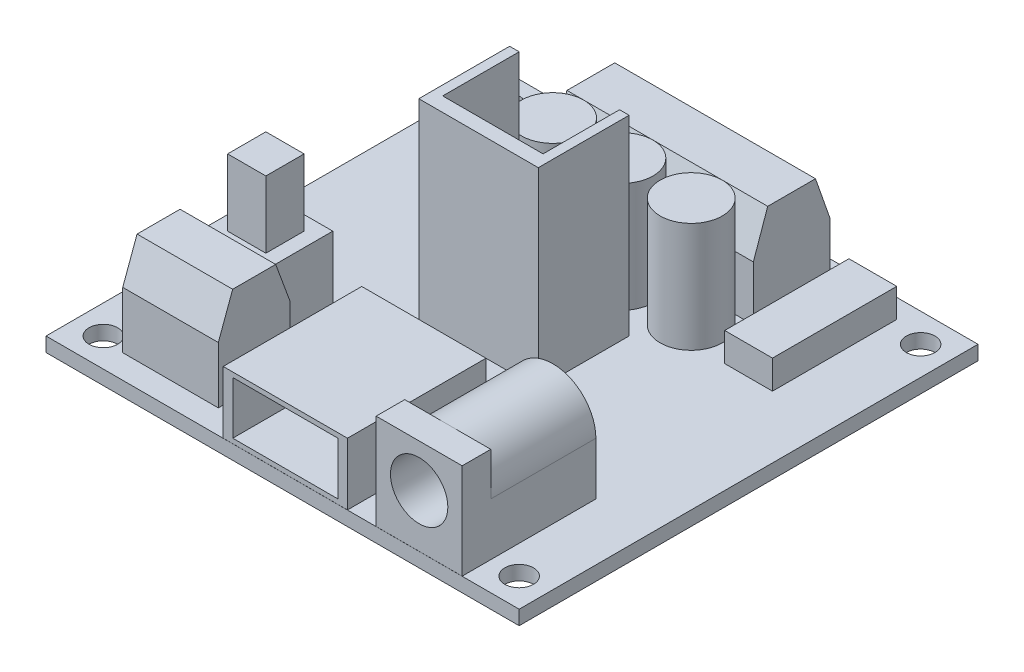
from build123d import *

# Parameters (mm, degrees)
SKETCH_1_W          = 49.5
SKETCH_1_H          = 48
SKETCH_1_R          = 1.5
EXTRUDE_1_DEPTH     = 1.5
SKETCH_2_W          = 21
SKETCH_2_H          = 8
EXTRUDE_2_DEPTH     = 10
CUT_EXTRUDE_2_DEPTH = 23
SKETCH_4_W          = 5
SKETCH_4_H          = 13
EXTRUDE_3_DEPTH     = 3
SKETCH_5_R          = 3.25
EXTRUDE_5_DEPTH     = 11.5
EXTRUDE_5_2_DEPTH   = 11.5
EXTRUDE_5_3_DEPTH   = 11.5
EXTRUDE_6_DEPTH     = 20
SKETCH_7_W          = 7
SKETCH_7_H          = 7
EXTRUDE_7_DEPTH     = 7
SKETCH_8_W          = 4
SKETCH_8_H          = 4
EXTRUDE_8_DEPTH     = 7
SKETCH_9_W          = 10
SKETCH_9_H          = 7.5
EXTRUDE_10_DEPTH    = 10
SKETCH_10_W         = 13
SKETCH_10_H         = 14.503390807
EXTRUDE_11_DEPTH    = 6.5
SKETCH_12_W         = 11
SKETCH_12_H         = 5.5
CUT_EXTRUDE_3_DEPTH = 13.5
SKETCH_13_W         = 9
SKETCH_13_H         = 14
EXTRUDE_12_DEPTH    = 10
CUT_EXTRUDE_4_DEPTH = 11
SKETCH_16_R         = 3
CUT_EXTRUDE_5_DEPTH = 9
SKETCH_17_W         = 25
SKETCH_17_H         = 10
CUT_EXTRUDE_6_DEPTH = 0.01
CUT_EXTRUDE_7_DEPTH = 10


with BuildPart() as part:
    # Sketch 1 → Extrude 1 (new body)
    with BuildSketch(Plane(origin=(0, 0, 0), x_dir=(1, 0, 0), z_dir=(0, 1, 0))):
        with Locations((20.165519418, 19.554443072)):
            Rectangle(SKETCH_1_W, SKETCH_1_H)
        with Locations(Location((-1.584480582, -1.445556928, 0), (0, 0, 270))):
            Circle(SKETCH_1_R, mode=Mode.SUBTRACT)
        with Locations(Location((-1.584480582, 40.554443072, 0), (0, 0, 90))):
            Circle(SKETCH_1_R, mode=Mode.SUBTRACT)
        with Locations(Location((41.915519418, -1.445556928, 0), (0, 0, 90))):
            Circle(SKETCH_1_R, mode=Mode.SUBTRACT)
        with Locations(Location((41.915519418, 40.554443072, 0), (0, 0, 270))):
            Circle(SKETCH_1_R, mode=Mode.SUBTRACT)
    extrude(amount=EXTRUDE_1_DEPTH)

    # Sketch 2 → Extrude 2 (add)
    with BuildSketch(Plane(origin=(0, 1.5, 0), x_dir=(1, 0, 0), z_dir=(0, 1, 0))):
        with Locations((20.915519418, 37.554443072)):
            Rectangle(SKETCH_2_W, SKETCH_2_H)
    extrude(amount=EXTRUDE_2_DEPTH)

    # Sketch 3 → Cut-Extrude 2 (cut)
    with BuildSketch(Plane(origin=(31.415519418, 0, 0), x_dir=(0, 0, -1), z_dir=(1, 0, 0))):
        Polygon((33.554443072, 7.210545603), (30.163008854, 7.675920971), (31.064673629, 12.678706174), (44.735075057, 12.009729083), (43.426206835, 7.210545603), (41.554443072, 7.210545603), (40.054443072, 11.5), (35.054443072, 11.5), align=None)
    extrude(amount=-CUT_EXTRUDE_2_DEPTH, mode=Mode.SUBTRACT)

    # Sketch 4 → Extrude 3 (add)
    with BuildSketch(Plane(origin=(0, 1.5, 0), x_dir=(1, 0, 0), z_dir=(0, 1, 0))):
        with Locations((35.915519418, 35.054443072)):
            Rectangle(SKETCH_4_W, SKETCH_4_H)
        with Locations((5.915519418, 35.054443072)):
            Rectangle(SKETCH_4_W, SKETCH_4_H)
    extrude(amount=EXTRUDE_3_DEPTH)

    # Sketch 6 → Extrude 6 (add)
    with BuildSketch(Plane(origin=(0, 1.5, 0), x_dir=(1, 0, 0), z_dir=(0, 1, 0))):
        Polygon((13.415519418, 26.054443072), (14.415519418, 26.054443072), (14.415519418, 18.054443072), (24.915519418, 18.054443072), (24.915519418, 26.054443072), (25.915519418, 26.054443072), (25.915519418, 16.554443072), (13.415519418, 16.554443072), align=None)
    extrude(amount=EXTRUDE_6_DEPTH)

    # Sketch 7 → Extrude 7 (add)
    with BuildSketch(Plane(origin=(0, 1.5, 0), x_dir=(1, 0, 0), z_dir=(0, 1, 0))):
        with Locations((4.415519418, 9.554443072)):
            Rectangle(SKETCH_7_W, SKETCH_7_H)
    extrude(amount=EXTRUDE_7_DEPTH)

    # Sketch 8 → Extrude 8 (add)
    with BuildSketch(Plane(origin=(0, 8.5, 0), x_dir=(1, 0, 0), z_dir=(0, 1, 0))):
        with Locations((4.415519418, 9.554443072)):
            Rectangle(SKETCH_8_W, SKETCH_8_H)
    extrude(amount=EXTRUDE_8_DEPTH)

    # Sketch 9 → Extrude 10 (add)
    with BuildSketch(Plane(origin=(0, 1.5, 0), x_dir=(1, 0, 0), z_dir=(0, 1, 0))):
        with Locations((5.942739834, 1.804443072)):
            Rectangle(SKETCH_9_W, SKETCH_9_H)
    extrude(amount=EXTRUDE_10_DEPTH)

    # Sketch 10 → Extrude 11 (add)
    with BuildSketch(Plane(origin=(0, 1.5, 0), x_dir=(1, 0, 0), z_dir=(0, 1, 0))):
        with Locations((20.442739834, 2.806142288)):
            Rectangle(SKETCH_10_W, SKETCH_10_H)
    extrude(amount=EXTRUDE_11_DEPTH)

    # Sketch 12 → Cut-Extrude 3 (cut)
    with BuildSketch(Plane.XY.offset(4.445556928)):
        with Locations((20.442739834, 4.75)):
            Rectangle(SKETCH_12_W, SKETCH_12_H)
    extrude(amount=-CUT_EXTRUDE_3_DEPTH, mode=Mode.SUBTRACT)

    # Sketch 13 → Extrude 12 (add)
    with BuildSketch(Plane(origin=(0, 1.5, 0), x_dir=(1, 0, 0), z_dir=(0, 1, 0))):
        with Locations((34.442739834, 2.554444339)):
            Rectangle(SKETCH_13_W, SKETCH_13_H)
    extrude(amount=EXTRUDE_12_DEPTH)

    # Sketch 14 → Cut-Extrude 4 (cut)
    with BuildSketch(Plane(origin=(0, 0, -9.554444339), x_dir=(-1, 0, 0), z_dir=(0, 0, -1))):
        with BuildLine():
            Line((-38.942739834, 7), (-40.649271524, 7))
            Line((-40.649271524, 7), (-41.483365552, 13.649696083))
            Line((-41.483365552, 13.649696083), (-29.942739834, 15.097276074))
            Line((-29.942739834, 15.097276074), (-28.985608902, 14.015488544))
            Line((-28.985608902, 14.015488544), (-28.985608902, 7))
            Line((-28.985608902, 7), (-29.942739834, 7))
            ThreePointArc((-29.942739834, 7), (-34.442739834, 11.5), (-38.942739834, 7))
        make_face()
    extrude(amount=-CUT_EXTRUDE_4_DEPTH, mode=Mode.SUBTRACT)

    # Sketch 16 → Cut-Extrude 5 (cut)
    with BuildSketch(Plane.XY.offset(4.445556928)):
        with Locations((34.442739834, 7)):
            Circle(SKETCH_16_R)
    extrude(amount=-CUT_EXTRUDE_5_DEPTH, mode=Mode.SUBTRACT)

    # Sketch 17 → Cut-Extrude 6 (cut)
    with BuildSketch(Plane.XY.offset(4.445556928)):
        with Locations((26.442739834, 6.5)):
            Rectangle(SKETCH_17_W, SKETCH_17_H)
    extrude(amount=-CUT_EXTRUDE_6_DEPTH, mode=Mode.SUBTRACT)

    # Sketch 18 → Cut-Extrude 7 (cut)
    with BuildSketch(Plane.ZY.offset(-0.942739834)):
        Polygon((-4.054443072, 11.5), (-5.554443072, 7.422658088), (-6.896901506, 12.54570275), (-4.804443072, 15.26529016), (3.364729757, 13.529529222), (4.358831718, 9.735870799), (1.945556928, 7.422658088), (0.445556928, 11.5), align=None)
    extrude(amount=-CUT_EXTRUDE_7_DEPTH, mode=Mode.SUBTRACT)


with BuildPart() as body_2:
    # Sketch 5 → Extrude 5 (new body)
    with BuildSketch(Plane(origin=(0, 1.5, 0), x_dir=(1, 0, 0), z_dir=(0, 1, 0))):
        with Locations(Location((13.665519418, 30.304443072, 0), (0, 0, 270))):
            Circle(SKETCH_5_R)
    extrude(amount=EXTRUDE_5_DEPTH)


with BuildPart() as body_3:
    # Sketch 5 → Extrude 5 2 (new body)
    with BuildSketch(Plane(origin=(0, 1.5, 0), x_dir=(1, 0, 0), z_dir=(0, 1, 0))):
        with Locations(Location((20.915519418, 30.304443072, 0), (0, 0, 270))):
            Circle(SKETCH_5_R)
    extrude(amount=EXTRUDE_5_2_DEPTH)


with BuildPart() as body_4:
    # Sketch 5 → Extrude 5 3 (new body)
    with BuildSketch(Plane(origin=(0, 1.5, 0), x_dir=(1, 0, 0), z_dir=(0, 1, 0))):
        with Locations(Location((28.165519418, 30.304443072, 0), (0, 0, 270))):
            Circle(SKETCH_5_R)
    extrude(amount=EXTRUDE_5_3_DEPTH)


solid = Compound([part.part, body_2.part, body_3.part, body_4.part])
